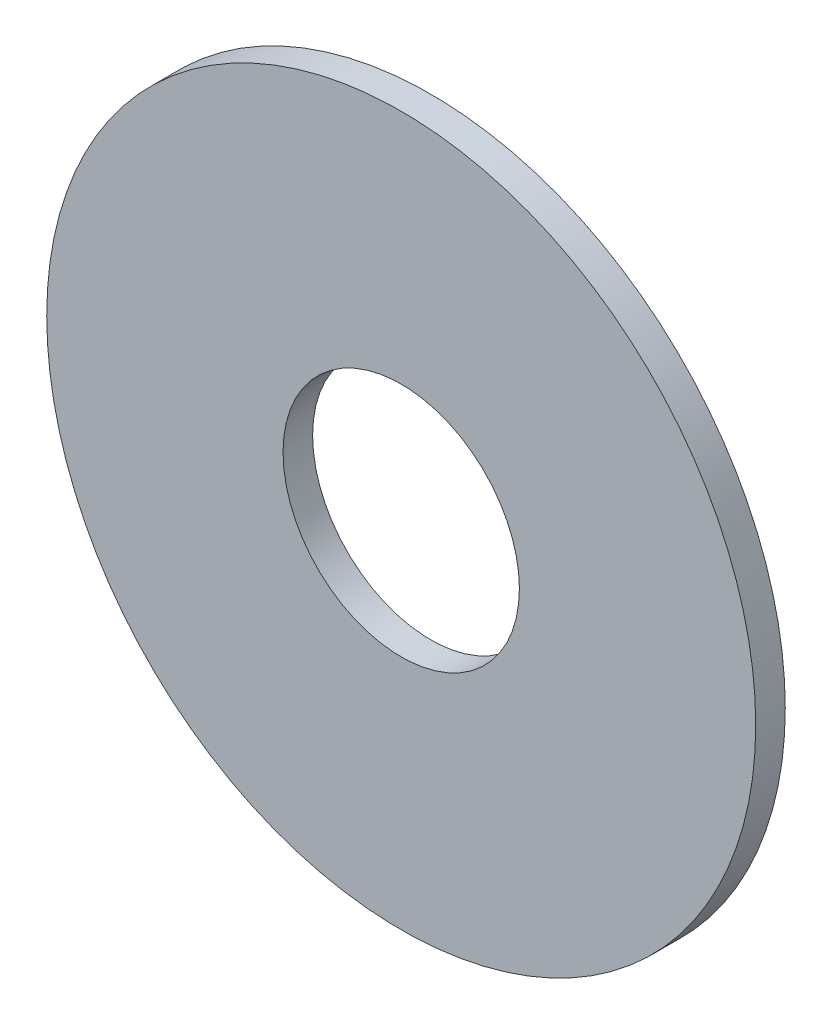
from build123d import *

# Parameters (mm, degrees)
SKETCH_1_R        = 12
SKETCH_1_R_2      = 4
EXTRUDE_216_DEPTH = 1


with BuildPart() as part:
    # Sketch 1 → Extrude 216 (new body)
    with BuildSketch(Plane.XY):
        with Locations((-10, -20)):
            Circle(SKETCH_1_R)
        with Locations((-10, -20)):
            Circle(SKETCH_1_R_2, mode=Mode.SUBTRACT)
    extrude(amount=EXTRUDE_216_DEPTH)


solid = part.part
